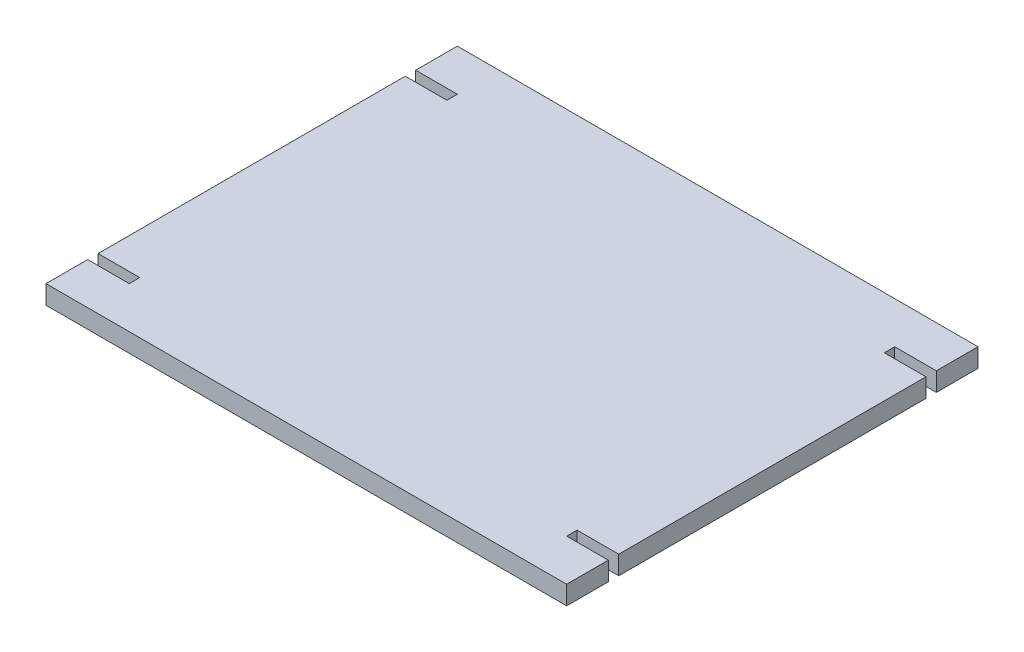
ISO-10303-21;
HEADER;
FILE_DESCRIPTION(('STEP AP214'),'2;1');
FILE_NAME('part.step','',(''),(''),'','','');
FILE_SCHEMA(('AUTOMOTIVE_DESIGN { 1 0 10303 214 1 1 1 1 }'));
ENDSEC;
DATA;
#1=APPLICATION_CONTEXT('core data for automotive mechanical design processes');
#2=APPLICATION_PROTOCOL_DEFINITION('international standard','automotive_design',2000,#1);
#3=PRODUCT_CONTEXT('',#1,'mechanical');
#4=PRODUCT('Part','Part','',(#3));
#5=PRODUCT_RELATED_PRODUCT_CATEGORY('part','',(#4));
#6=PRODUCT_DEFINITION_FORMATION('','',#4);
#7=PRODUCT_DEFINITION_CONTEXT('part definition',#1,'design');
#8=PRODUCT_DEFINITION('design','',#6,#7);
#9=PRODUCT_DEFINITION_SHAPE('','',#8);
#10=(LENGTH_UNIT() NAMED_UNIT(*) SI_UNIT(.MILLI.,.METRE.));
#11=(NAMED_UNIT(*) PLANE_ANGLE_UNIT() SI_UNIT($,.RADIAN.));
#12=(NAMED_UNIT(*) SI_UNIT($,.STERADIAN.) SOLID_ANGLE_UNIT());
#13=UNCERTAINTY_MEASURE_WITH_UNIT(LENGTH_MEASURE(1.E-05),#10,'distance_accuracy_value','');
#14=(GEOMETRIC_REPRESENTATION_CONTEXT(3) GLOBAL_UNCERTAINTY_ASSIGNED_CONTEXT((#13)) GLOBAL_UNIT_ASSIGNED_CONTEXT((#10,
#11,#12)) REPRESENTATION_CONTEXT('',''));
#15=CARTESIAN_POINT('',(0.,0.,0.));
#16=DIRECTION('',(0.,0.,1.));
#17=DIRECTION('',(1.,0.,0.));
#18=AXIS2_PLACEMENT_3D('',#15,#16,#17);
#19=CARTESIAN_POINT('',(-301.875,18.,-168.229166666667));
#20=DIRECTION('',(1.,0.,0.));
#21=DIRECTION('',(0.,0.,-1.));
#22=AXIS2_PLACEMENT_3D('',#19,#20,#21);
#23=PLANE('',#22);
#24=DIRECTION('',(0.,0.,1.));
#25=VECTOR('',#24,1.);
#26=CARTESIAN_POINT('',(-301.875,0.,-168.229166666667));
#27=LINE('',#26,#25);
#28=CARTESIAN_POINT('',(-301.875,0.,-208.229166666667));
#29=VERTEX_POINT('',#28);
#30=CARTESIAN_POINT('',(-301.875,0.,-168.229166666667));
#31=VERTEX_POINT('',#30);
#32=EDGE_CURVE('E203',#29,#31,#27,.T.);
#33=ORIENTED_EDGE('',*,*,#32,.T.);
#34=DIRECTION('',(0.,-1.,0.));
#35=VECTOR('',#34,1.);
#36=CARTESIAN_POINT('',(-301.875,18.,-168.229166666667));
#37=LINE('',#36,#35);
#38=CARTESIAN_POINT('',(-301.875,18.,-168.229166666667));
#39=VERTEX_POINT('',#38);
#40=EDGE_CURVE('E11',#39,#31,#37,.T.);
#41=ORIENTED_EDGE('',*,*,#40,.F.);
#42=DIRECTION('',(0.,0.,1.));
#43=VECTOR('',#42,1.);
#44=CARTESIAN_POINT('',(-301.875,18.,-168.229166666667));
#45=LINE('',#44,#43);
#46=CARTESIAN_POINT('',(-301.875,18.,-208.229166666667));
#47=VERTEX_POINT('',#46);
#48=EDGE_CURVE('E241',#47,#39,#45,.T.);
#49=ORIENTED_EDGE('',*,*,#48,.F.);
#50=DIRECTION('',(0.,-1.,0.));
#51=VECTOR('',#50,1.);
#52=CARTESIAN_POINT('',(-301.875,18.,-208.229166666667));
#53=LINE('',#52,#51);
#54=EDGE_CURVE('E199',#47,#29,#53,.T.);
#55=ORIENTED_EDGE('',*,*,#54,.T.);
#56=EDGE_LOOP('',(#33,#41,#49,#55));
#57=FACE_BOUND('',#56,.T.);
#58=ADVANCED_FACE('F35',(#57),#23,.F.);
#59=CARTESIAN_POINT('',(-261.875,18.,-168.229166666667));
#60=DIRECTION('',(0.,0.,-1.));
#61=DIRECTION('',(-1.,0.,0.));
#62=AXIS2_PLACEMENT_3D('',#59,#60,#61);
#63=PLANE('',#62);
#64=DIRECTION('',(1.,0.,0.));
#65=VECTOR('',#64,1.);
#66=CARTESIAN_POINT('',(-261.875,0.,-168.229166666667));
#67=LINE('',#66,#65);
#68=CARTESIAN_POINT('',(-261.875,0.,-168.229166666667));
#69=VERTEX_POINT('',#68);
#70=EDGE_CURVE('E206',#31,#69,#67,.T.);
#71=ORIENTED_EDGE('',*,*,#70,.T.);
#72=DIRECTION('',(0.,-1.,0.));
#73=VECTOR('',#72,1.);
#74=CARTESIAN_POINT('',(-261.875,18.,-168.229166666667));
#75=LINE('',#74,#73);
#76=CARTESIAN_POINT('',(-261.875,18.,-168.229166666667));
#77=VERTEX_POINT('',#76);
#78=EDGE_CURVE('E43',#77,#69,#75,.T.);
#79=ORIENTED_EDGE('',*,*,#78,.F.);
#80=DIRECTION('',(1.,0.,0.));
#81=VECTOR('',#80,1.);
#82=CARTESIAN_POINT('',(-261.875,18.,-168.229166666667));
#83=LINE('',#82,#81);
#84=EDGE_CURVE('E130',#39,#77,#83,.T.);
#85=ORIENTED_EDGE('',*,*,#84,.F.);
#86=ORIENTED_EDGE('',*,*,#40,.T.);
#87=EDGE_LOOP('',(#71,#79,#85,#86));
#88=FACE_BOUND('',#87,.T.);
#89=ADVANCED_FACE('F359',(#88),#63,.F.);
#90=CARTESIAN_POINT('',(-261.875,18.,-158.229166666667));
#91=DIRECTION('',(1.,0.,0.));
#92=DIRECTION('',(0.,0.,-1.));
#93=AXIS2_PLACEMENT_3D('',#90,#91,#92);
#94=PLANE('',#93);
#95=DIRECTION('',(0.,0.,1.));
#96=VECTOR('',#95,1.);
#97=CARTESIAN_POINT('',(-261.875,0.,-158.229166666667));
#98=LINE('',#97,#96);
#99=CARTESIAN_POINT('',(-261.875,0.,-158.229166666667));
#100=VERTEX_POINT('',#99);
#101=EDGE_CURVE('E208',#69,#100,#98,.T.);
#102=ORIENTED_EDGE('',*,*,#101,.T.);
#103=DIRECTION('',(0.,-1.,0.));
#104=VECTOR('',#103,1.);
#105=CARTESIAN_POINT('',(-261.875,18.,-158.229166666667));
#106=LINE('',#105,#104);
#107=CARTESIAN_POINT('',(-261.875,18.,-158.229166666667));
#108=VERTEX_POINT('',#107);
#109=EDGE_CURVE('E284',#108,#100,#106,.T.);
#110=ORIENTED_EDGE('',*,*,#109,.F.);
#111=DIRECTION('',(0.,0.,1.));
#112=VECTOR('',#111,1.);
#113=CARTESIAN_POINT('',(-261.875,18.,-158.229166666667));
#114=LINE('',#113,#112);
#115=EDGE_CURVE('E292',#77,#108,#114,.T.);
#116=ORIENTED_EDGE('',*,*,#115,.F.);
#117=ORIENTED_EDGE('',*,*,#78,.T.);
#118=EDGE_LOOP('',(#102,#110,#116,#117));
#119=FACE_BOUND('',#118,.T.);
#120=ADVANCED_FACE('F290',(#119),#94,.F.);
#121=CARTESIAN_POINT('',(-301.875,18.,-158.229166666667));
#122=DIRECTION('',(0.,0.,1.));
#123=DIRECTION('',(1.,0.,0.));
#124=AXIS2_PLACEMENT_3D('',#121,#122,#123);
#125=PLANE('',#124);
#126=DIRECTION('',(-1.,0.,0.));
#127=VECTOR('',#126,1.);
#128=CARTESIAN_POINT('',(-301.875,0.,-158.229166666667));
#129=LINE('',#128,#127);
#130=CARTESIAN_POINT('',(-301.875,0.,-158.229166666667));
#131=VERTEX_POINT('',#130);
#132=EDGE_CURVE('E210',#100,#131,#129,.T.);
#133=ORIENTED_EDGE('',*,*,#132,.T.);
#134=DIRECTION('',(0.,-1.,0.));
#135=VECTOR('',#134,1.);
#136=CARTESIAN_POINT('',(-301.875,18.,-158.229166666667));
#137=LINE('',#136,#135);
#138=CARTESIAN_POINT('',(-301.875,18.,-158.229166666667));
#139=VERTEX_POINT('',#138);
#140=EDGE_CURVE('E281',#139,#131,#137,.T.);
#141=ORIENTED_EDGE('',*,*,#140,.F.);
#142=DIRECTION('',(-1.,0.,0.));
#143=VECTOR('',#142,1.);
#144=CARTESIAN_POINT('',(-301.875,18.,-158.229166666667));
#145=LINE('',#144,#143);
#146=EDGE_CURVE('E310',#108,#139,#145,.T.);
#147=ORIENTED_EDGE('',*,*,#146,.F.);
#148=ORIENTED_EDGE('',*,*,#109,.T.);
#149=EDGE_LOOP('',(#133,#141,#147,#148));
#150=FACE_BOUND('',#149,.T.);
#151=ADVANCED_FACE('F301',(#150),#125,.F.);
#152=CARTESIAN_POINT('',(-301.875,18.,136.770833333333));
#153=DIRECTION('',(1.,0.,0.));
#154=DIRECTION('',(0.,0.,-1.));
#155=AXIS2_PLACEMENT_3D('',#152,#153,#154);
#156=PLANE('',#155);
#157=DIRECTION('',(0.,0.,1.));
#158=VECTOR('',#157,1.);
#159=CARTESIAN_POINT('',(-301.875,0.,136.770833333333));
#160=LINE('',#159,#158);
#161=CARTESIAN_POINT('',(-301.875,0.,136.770833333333));
#162=VERTEX_POINT('',#161);
#163=EDGE_CURVE('E212',#131,#162,#160,.T.);
#164=ORIENTED_EDGE('',*,*,#163,.T.);
#165=DIRECTION('',(0.,-1.,0.));
#166=VECTOR('',#165,1.);
#167=CARTESIAN_POINT('',(-301.875,18.,136.770833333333));
#168=LINE('',#167,#166);
#169=CARTESIAN_POINT('',(-301.875,18.,136.770833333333));
#170=VERTEX_POINT('',#169);
#171=EDGE_CURVE('E278',#170,#162,#168,.T.);
#172=ORIENTED_EDGE('',*,*,#171,.F.);
#173=DIRECTION('',(0.,0.,1.));
#174=VECTOR('',#173,1.);
#175=CARTESIAN_POINT('',(-301.875,18.,136.770833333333));
#176=LINE('',#175,#174);
#177=EDGE_CURVE('E307',#139,#170,#176,.T.);
#178=ORIENTED_EDGE('',*,*,#177,.F.);
#179=ORIENTED_EDGE('',*,*,#140,.T.);
#180=EDGE_LOOP('',(#164,#172,#178,#179));
#181=FACE_BOUND('',#180,.T.);
#182=ADVANCED_FACE('F305',(#181),#156,.F.);
#183=CARTESIAN_POINT('',(-261.875,18.,136.770833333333));
#184=DIRECTION('',(0.,0.,-1.));
#185=DIRECTION('',(-1.,0.,0.));
#186=AXIS2_PLACEMENT_3D('',#183,#184,#185);
#187=PLANE('',#186);
#188=DIRECTION('',(1.,0.,0.));
#189=VECTOR('',#188,1.);
#190=CARTESIAN_POINT('',(-261.875,0.,136.770833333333));
#191=LINE('',#190,#189);
#192=CARTESIAN_POINT('',(-261.875,0.,136.770833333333));
#193=VERTEX_POINT('',#192);
#194=EDGE_CURVE('E214',#162,#193,#191,.T.);
#195=ORIENTED_EDGE('',*,*,#194,.T.);
#196=DIRECTION('',(0.,-1.,0.));
#197=VECTOR('',#196,1.);
#198=CARTESIAN_POINT('',(-261.875,18.,136.770833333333));
#199=LINE('',#198,#197);
#200=CARTESIAN_POINT('',(-261.875,18.,136.770833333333));
#201=VERTEX_POINT('',#200);
#202=EDGE_CURVE('E275',#201,#193,#199,.T.);
#203=ORIENTED_EDGE('',*,*,#202,.F.);
#204=DIRECTION('',(1.,0.,0.));
#205=VECTOR('',#204,1.);
#206=CARTESIAN_POINT('',(-261.875,18.,136.770833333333));
#207=LINE('',#206,#205);
#208=EDGE_CURVE('E309',#170,#201,#207,.T.);
#209=ORIENTED_EDGE('',*,*,#208,.F.);
#210=ORIENTED_EDGE('',*,*,#171,.T.);
#211=EDGE_LOOP('',(#195,#203,#209,#210));
#212=FACE_BOUND('',#211,.T.);
#213=ADVANCED_FACE('F372',(#212),#187,.F.);
#214=CARTESIAN_POINT('',(-261.875,18.,146.770833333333));
#215=DIRECTION('',(1.,0.,0.));
#216=DIRECTION('',(0.,0.,-1.));
#217=AXIS2_PLACEMENT_3D('',#214,#215,#216);
#218=PLANE('',#217);
#219=DIRECTION('',(0.,0.,1.));
#220=VECTOR('',#219,1.);
#221=CARTESIAN_POINT('',(-261.875,0.,146.770833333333));
#222=LINE('',#221,#220);
#223=CARTESIAN_POINT('',(-261.875,0.,146.770833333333));
#224=VERTEX_POINT('',#223);
#225=EDGE_CURVE('E216',#193,#224,#222,.T.);
#226=ORIENTED_EDGE('',*,*,#225,.T.);
#227=DIRECTION('',(0.,-1.,0.));
#228=VECTOR('',#227,1.);
#229=CARTESIAN_POINT('',(-261.875,18.,146.770833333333));
#230=LINE('',#229,#228);
#231=CARTESIAN_POINT('',(-261.875,18.,146.770833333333));
#232=VERTEX_POINT('',#231);
#233=EDGE_CURVE('E272',#232,#224,#230,.T.);
#234=ORIENTED_EDGE('',*,*,#233,.F.);
#235=DIRECTION('',(0.,0.,1.));
#236=VECTOR('',#235,1.);
#237=CARTESIAN_POINT('',(-261.875,18.,146.770833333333));
#238=LINE('',#237,#236);
#239=EDGE_CURVE('E312',#201,#232,#238,.T.);
#240=ORIENTED_EDGE('',*,*,#239,.F.);
#241=ORIENTED_EDGE('',*,*,#202,.T.);
#242=EDGE_LOOP('',(#226,#234,#240,#241));
#243=FACE_BOUND('',#242,.T.);
#244=ADVANCED_FACE('F375',(#243),#218,.F.);
#245=CARTESIAN_POINT('',(-301.875,18.,146.770833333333));
#246=DIRECTION('',(0.,0.,1.));
#247=DIRECTION('',(1.,0.,0.));
#248=AXIS2_PLACEMENT_3D('',#245,#246,#247);
#249=PLANE('',#248);
#250=DIRECTION('',(-1.,0.,0.));
#251=VECTOR('',#250,1.);
#252=CARTESIAN_POINT('',(-301.875,0.,146.770833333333));
#253=LINE('',#252,#251);
#254=CARTESIAN_POINT('',(-301.875,0.,146.770833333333));
#255=VERTEX_POINT('',#254);
#256=EDGE_CURVE('E218',#224,#255,#253,.T.);
#257=ORIENTED_EDGE('',*,*,#256,.T.);
#258=DIRECTION('',(0.,-1.,0.));
#259=VECTOR('',#258,1.);
#260=CARTESIAN_POINT('',(-301.875,18.,146.770833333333));
#261=LINE('',#260,#259);
#262=CARTESIAN_POINT('',(-301.875,18.,146.770833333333));
#263=VERTEX_POINT('',#262);
#264=EDGE_CURVE('E269',#263,#255,#261,.T.);
#265=ORIENTED_EDGE('',*,*,#264,.F.);
#266=DIRECTION('',(-1.,0.,0.));
#267=VECTOR('',#266,1.);
#268=CARTESIAN_POINT('',(-301.875,18.,146.770833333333));
#269=LINE('',#268,#267);
#270=EDGE_CURVE('E318',#232,#263,#269,.T.);
#271=ORIENTED_EDGE('',*,*,#270,.F.);
#272=ORIENTED_EDGE('',*,*,#233,.T.);
#273=EDGE_LOOP('',(#257,#265,#271,#272));
#274=FACE_BOUND('',#273,.T.);
#275=ADVANCED_FACE('F379',(#274),#249,.F.);
#276=CARTESIAN_POINT('',(-301.875,18.,186.770833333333));
#277=DIRECTION('',(1.,0.,0.));
#278=DIRECTION('',(0.,0.,-1.));
#279=AXIS2_PLACEMENT_3D('',#276,#277,#278);
#280=PLANE('',#279);
#281=DIRECTION('',(0.,0.,1.));
#282=VECTOR('',#281,1.);
#283=CARTESIAN_POINT('',(-301.875,0.,186.770833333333));
#284=LINE('',#283,#282);
#285=CARTESIAN_POINT('',(-301.875,0.,186.770833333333));
#286=VERTEX_POINT('',#285);
#287=EDGE_CURVE('E220',#255,#286,#284,.T.);
#288=ORIENTED_EDGE('',*,*,#287,.T.);
#289=DIRECTION('',(0.,-1.,0.));
#290=VECTOR('',#289,1.);
#291=CARTESIAN_POINT('',(-301.875,18.,186.770833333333));
#292=LINE('',#291,#290);
#293=CARTESIAN_POINT('',(-301.875,18.,186.770833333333));
#294=VERTEX_POINT('',#293);
#295=EDGE_CURVE('E266',#294,#286,#292,.T.);
#296=ORIENTED_EDGE('',*,*,#295,.F.);
#297=DIRECTION('',(0.,0.,1.));
#298=VECTOR('',#297,1.);
#299=CARTESIAN_POINT('',(-301.875,18.,186.770833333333));
#300=LINE('',#299,#298);
#301=EDGE_CURVE('E320',#263,#294,#300,.T.);
#302=ORIENTED_EDGE('',*,*,#301,.F.);
#303=ORIENTED_EDGE('',*,*,#264,.T.);
#304=EDGE_LOOP('',(#288,#296,#302,#303));
#305=FACE_BOUND('',#304,.T.);
#306=ADVANCED_FACE('F383',(#305),#280,.F.);
#307=CARTESIAN_POINT('',(198.125,18.,186.770833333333));
#308=DIRECTION('',(0.,0.,-1.));
#309=DIRECTION('',(-1.,0.,0.));
#310=AXIS2_PLACEMENT_3D('',#307,#308,#309);
#311=PLANE('',#310);
#312=DIRECTION('',(1.,0.,0.));
#313=VECTOR('',#312,1.);
#314=CARTESIAN_POINT('',(198.125,0.,186.770833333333));
#315=LINE('',#314,#313);
#316=CARTESIAN_POINT('',(198.125,0.,186.770833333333));
#317=VERTEX_POINT('',#316);
#318=EDGE_CURVE('E222',#286,#317,#315,.T.);
#319=ORIENTED_EDGE('',*,*,#318,.T.);
#320=DIRECTION('',(0.,-1.,0.));
#321=VECTOR('',#320,1.);
#322=CARTESIAN_POINT('',(198.125,18.,186.770833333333));
#323=LINE('',#322,#321);
#324=CARTESIAN_POINT('',(198.125,18.,186.770833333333));
#325=VERTEX_POINT('',#324);
#326=EDGE_CURVE('E263',#325,#317,#323,.T.);
#327=ORIENTED_EDGE('',*,*,#326,.F.);
#328=DIRECTION('',(1.,0.,0.));
#329=VECTOR('',#328,1.);
#330=CARTESIAN_POINT('',(198.125,18.,186.770833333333));
#331=LINE('',#330,#329);
#332=EDGE_CURVE('E322',#294,#325,#331,.T.);
#333=ORIENTED_EDGE('',*,*,#332,.F.);
#334=ORIENTED_EDGE('',*,*,#295,.T.);
#335=EDGE_LOOP('',(#319,#327,#333,#334));
#336=FACE_BOUND('',#335,.T.);
#337=ADVANCED_FACE('F387',(#336),#311,.F.);
#338=CARTESIAN_POINT('',(198.125,18.,146.770833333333));
#339=DIRECTION('',(-1.,0.,0.));
#340=DIRECTION('',(0.,0.,1.));
#341=AXIS2_PLACEMENT_3D('',#338,#339,#340);
#342=PLANE('',#341);
#343=DIRECTION('',(0.,0.,-1.));
#344=VECTOR('',#343,1.);
#345=CARTESIAN_POINT('',(198.125,0.,146.770833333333));
#346=LINE('',#345,#344);
#347=CARTESIAN_POINT('',(198.125,0.,146.770833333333));
#348=VERTEX_POINT('',#347);
#349=EDGE_CURVE('E224',#317,#348,#346,.T.);
#350=ORIENTED_EDGE('',*,*,#349,.T.);
#351=DIRECTION('',(0.,-1.,0.));
#352=VECTOR('',#351,1.);
#353=CARTESIAN_POINT('',(198.125,18.,146.770833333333));
#354=LINE('',#353,#352);
#355=CARTESIAN_POINT('',(198.125,18.,146.770833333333));
#356=VERTEX_POINT('',#355);
#357=EDGE_CURVE('E260',#356,#348,#354,.T.);
#358=ORIENTED_EDGE('',*,*,#357,.F.);
#359=DIRECTION('',(0.,0.,-1.));
#360=VECTOR('',#359,1.);
#361=CARTESIAN_POINT('',(198.125,18.,146.770833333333));
#362=LINE('',#361,#360);
#363=EDGE_CURVE('E324',#325,#356,#362,.T.);
#364=ORIENTED_EDGE('',*,*,#363,.F.);
#365=ORIENTED_EDGE('',*,*,#326,.T.);
#366=EDGE_LOOP('',(#350,#358,#364,#365));
#367=FACE_BOUND('',#366,.T.);
#368=ADVANCED_FACE('F391',(#367),#342,.F.);
#369=CARTESIAN_POINT('',(158.125,18.,146.770833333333));
#370=DIRECTION('',(0.,0.,1.));
#371=DIRECTION('',(1.,0.,0.));
#372=AXIS2_PLACEMENT_3D('',#369,#370,#371);
#373=PLANE('',#372);
#374=DIRECTION('',(-1.,0.,0.));
#375=VECTOR('',#374,1.);
#376=CARTESIAN_POINT('',(158.125,0.,146.770833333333));
#377=LINE('',#376,#375);
#378=CARTESIAN_POINT('',(158.125,0.,146.770833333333));
#379=VERTEX_POINT('',#378);
#380=EDGE_CURVE('E226',#348,#379,#377,.T.);
#381=ORIENTED_EDGE('',*,*,#380,.T.);
#382=DIRECTION('',(0.,-1.,0.));
#383=VECTOR('',#382,1.);
#384=CARTESIAN_POINT('',(158.125,18.,146.770833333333));
#385=LINE('',#384,#383);
#386=CARTESIAN_POINT('',(158.125,18.,146.770833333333));
#387=VERTEX_POINT('',#386);
#388=EDGE_CURVE('E257',#387,#379,#385,.T.);
#389=ORIENTED_EDGE('',*,*,#388,.F.);
#390=DIRECTION('',(-1.,0.,0.));
#391=VECTOR('',#390,1.);
#392=CARTESIAN_POINT('',(158.125,18.,146.770833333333));
#393=LINE('',#392,#391);
#394=EDGE_CURVE('E326',#356,#387,#393,.T.);
#395=ORIENTED_EDGE('',*,*,#394,.F.);
#396=ORIENTED_EDGE('',*,*,#357,.T.);
#397=EDGE_LOOP('',(#381,#389,#395,#396));
#398=FACE_BOUND('',#397,.T.);
#399=ADVANCED_FACE('F395',(#398),#373,.F.);
#400=CARTESIAN_POINT('',(158.125,18.,136.770833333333));
#401=DIRECTION('',(-1.,0.,0.));
#402=DIRECTION('',(0.,0.,1.));
#403=AXIS2_PLACEMENT_3D('',#400,#401,#402);
#404=PLANE('',#403);
#405=DIRECTION('',(0.,0.,-1.));
#406=VECTOR('',#405,1.);
#407=CARTESIAN_POINT('',(158.125,0.,136.770833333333));
#408=LINE('',#407,#406);
#409=CARTESIAN_POINT('',(158.125,0.,136.770833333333));
#410=VERTEX_POINT('',#409);
#411=EDGE_CURVE('E228',#379,#410,#408,.T.);
#412=ORIENTED_EDGE('',*,*,#411,.T.);
#413=DIRECTION('',(0.,-1.,0.));
#414=VECTOR('',#413,1.);
#415=CARTESIAN_POINT('',(158.125,18.,136.770833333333));
#416=LINE('',#415,#414);
#417=CARTESIAN_POINT('',(158.125,18.,136.770833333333));
#418=VERTEX_POINT('',#417);
#419=EDGE_CURVE('E254',#418,#410,#416,.T.);
#420=ORIENTED_EDGE('',*,*,#419,.F.);
#421=DIRECTION('',(0.,0.,-1.));
#422=VECTOR('',#421,1.);
#423=CARTESIAN_POINT('',(158.125,18.,136.770833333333));
#424=LINE('',#423,#422);
#425=EDGE_CURVE('E328',#387,#418,#424,.T.);
#426=ORIENTED_EDGE('',*,*,#425,.F.);
#427=ORIENTED_EDGE('',*,*,#388,.T.);
#428=EDGE_LOOP('',(#412,#420,#426,#427));
#429=FACE_BOUND('',#428,.T.);
#430=ADVANCED_FACE('F399',(#429),#404,.F.);
#431=CARTESIAN_POINT('',(198.125,18.,136.770833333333));
#432=DIRECTION('',(0.,0.,-1.));
#433=DIRECTION('',(-1.,0.,0.));
#434=AXIS2_PLACEMENT_3D('',#431,#432,#433);
#435=PLANE('',#434);
#436=DIRECTION('',(1.,0.,0.));
#437=VECTOR('',#436,1.);
#438=CARTESIAN_POINT('',(198.125,0.,136.770833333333));
#439=LINE('',#438,#437);
#440=CARTESIAN_POINT('',(198.125,0.,136.770833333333));
#441=VERTEX_POINT('',#440);
#442=EDGE_CURVE('E230',#410,#441,#439,.T.);
#443=ORIENTED_EDGE('',*,*,#442,.T.);
#444=DIRECTION('',(0.,-1.,0.));
#445=VECTOR('',#444,1.);
#446=CARTESIAN_POINT('',(198.125,18.,136.770833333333));
#447=LINE('',#446,#445);
#448=CARTESIAN_POINT('',(198.125,18.,136.770833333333));
#449=VERTEX_POINT('',#448);
#450=EDGE_CURVE('E251',#449,#441,#447,.T.);
#451=ORIENTED_EDGE('',*,*,#450,.F.);
#452=DIRECTION('',(1.,0.,0.));
#453=VECTOR('',#452,1.);
#454=CARTESIAN_POINT('',(198.125,18.,136.770833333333));
#455=LINE('',#454,#453);
#456=EDGE_CURVE('E330',#418,#449,#455,.T.);
#457=ORIENTED_EDGE('',*,*,#456,.F.);
#458=ORIENTED_EDGE('',*,*,#419,.T.);
#459=EDGE_LOOP('',(#443,#451,#457,#458));
#460=FACE_BOUND('',#459,.T.);
#461=ADVANCED_FACE('F403',(#460),#435,.F.);
#462=CARTESIAN_POINT('',(198.125,18.,-158.229166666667));
#463=DIRECTION('',(-1.,0.,0.));
#464=DIRECTION('',(0.,0.,1.));
#465=AXIS2_PLACEMENT_3D('',#462,#463,#464);
#466=PLANE('',#465);
#467=DIRECTION('',(0.,0.,-1.));
#468=VECTOR('',#467,1.);
#469=CARTESIAN_POINT('',(198.125,0.,-158.229166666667));
#470=LINE('',#469,#468);
#471=CARTESIAN_POINT('',(198.125,0.,-158.229166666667));
#472=VERTEX_POINT('',#471);
#473=EDGE_CURVE('E232',#441,#472,#470,.T.);
#474=ORIENTED_EDGE('',*,*,#473,.T.);
#475=DIRECTION('',(0.,-1.,0.));
#476=VECTOR('',#475,1.);
#477=CARTESIAN_POINT('',(198.125,18.,-158.229166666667));
#478=LINE('',#477,#476);
#479=CARTESIAN_POINT('',(198.125,18.,-158.229166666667));
#480=VERTEX_POINT('',#479);
#481=EDGE_CURVE('E248',#480,#472,#478,.T.);
#482=ORIENTED_EDGE('',*,*,#481,.F.);
#483=DIRECTION('',(0.,0.,-1.));
#484=VECTOR('',#483,1.);
#485=CARTESIAN_POINT('',(198.125,18.,-158.229166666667));
#486=LINE('',#485,#484);
#487=EDGE_CURVE('E332',#449,#480,#486,.T.);
#488=ORIENTED_EDGE('',*,*,#487,.F.);
#489=ORIENTED_EDGE('',*,*,#450,.T.);
#490=EDGE_LOOP('',(#474,#482,#488,#489));
#491=FACE_BOUND('',#490,.T.);
#492=ADVANCED_FACE('F407',(#491),#466,.F.);
#493=CARTESIAN_POINT('',(158.125,18.,-158.229166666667));
#494=DIRECTION('',(0.,0.,1.));
#495=DIRECTION('',(1.,0.,0.));
#496=AXIS2_PLACEMENT_3D('',#493,#494,#495);
#497=PLANE('',#496);
#498=DIRECTION('',(-1.,0.,0.));
#499=VECTOR('',#498,1.);
#500=CARTESIAN_POINT('',(158.125,0.,-158.229166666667));
#501=LINE('',#500,#499);
#502=CARTESIAN_POINT('',(158.125,0.,-158.229166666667));
#503=VERTEX_POINT('',#502);
#504=EDGE_CURVE('E234',#472,#503,#501,.T.);
#505=ORIENTED_EDGE('',*,*,#504,.T.);
#506=DIRECTION('',(0.,-1.,0.));
#507=VECTOR('',#506,1.);
#508=CARTESIAN_POINT('',(158.125,18.,-158.229166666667));
#509=LINE('',#508,#507);
#510=CARTESIAN_POINT('',(158.125,18.,-158.229166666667));
#511=VERTEX_POINT('',#510);
#512=EDGE_CURVE('E245',#511,#503,#509,.T.);
#513=ORIENTED_EDGE('',*,*,#512,.F.);
#514=DIRECTION('',(-1.,0.,0.));
#515=VECTOR('',#514,1.);
#516=CARTESIAN_POINT('',(158.125,18.,-158.229166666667));
#517=LINE('',#516,#515);
#518=EDGE_CURVE('E334',#480,#511,#517,.T.);
#519=ORIENTED_EDGE('',*,*,#518,.F.);
#520=ORIENTED_EDGE('',*,*,#481,.T.);
#521=EDGE_LOOP('',(#505,#513,#519,#520));
#522=FACE_BOUND('',#521,.T.);
#523=ADVANCED_FACE('F340',(#522),#497,.F.);
#524=CARTESIAN_POINT('',(158.125,18.,-168.229166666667));
#525=DIRECTION('',(-1.,0.,0.));
#526=DIRECTION('',(0.,0.,1.));
#527=AXIS2_PLACEMENT_3D('',#524,#525,#526);
#528=PLANE('',#527);
#529=DIRECTION('',(0.,0.,-1.));
#530=VECTOR('',#529,1.);
#531=CARTESIAN_POINT('',(158.125,0.,-168.229166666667));
#532=LINE('',#531,#530);
#533=CARTESIAN_POINT('',(158.125,0.,-168.229166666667));
#534=VERTEX_POINT('',#533);
#535=EDGE_CURVE('E236',#503,#534,#532,.T.);
#536=ORIENTED_EDGE('',*,*,#535,.T.);
#537=DIRECTION('',(0.,-1.,0.));
#538=VECTOR('',#537,1.);
#539=CARTESIAN_POINT('',(158.125,18.,-168.229166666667));
#540=LINE('',#539,#538);
#541=CARTESIAN_POINT('',(158.125,18.,-168.229166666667));
#542=VERTEX_POINT('',#541);
#543=EDGE_CURVE('E194',#542,#534,#540,.T.);
#544=ORIENTED_EDGE('',*,*,#543,.F.);
#545=DIRECTION('',(0.,0.,-1.));
#546=VECTOR('',#545,1.);
#547=CARTESIAN_POINT('',(158.125,18.,-168.229166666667));
#548=LINE('',#547,#546);
#549=EDGE_CURVE('E185',#511,#542,#548,.T.);
#550=ORIENTED_EDGE('',*,*,#549,.F.);
#551=ORIENTED_EDGE('',*,*,#512,.T.);
#552=EDGE_LOOP('',(#536,#544,#550,#551));
#553=FACE_BOUND('',#552,.T.);
#554=ADVANCED_FACE('F344',(#553),#528,.F.);
#555=CARTESIAN_POINT('',(198.125,18.,-168.229166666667));
#556=DIRECTION('',(0.,0.,-1.));
#557=DIRECTION('',(-1.,0.,0.));
#558=AXIS2_PLACEMENT_3D('',#555,#556,#557);
#559=PLANE('',#558);
#560=DIRECTION('',(1.,0.,0.));
#561=VECTOR('',#560,1.);
#562=CARTESIAN_POINT('',(198.125,0.,-168.229166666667));
#563=LINE('',#562,#561);
#564=CARTESIAN_POINT('',(198.125,0.,-168.229166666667));
#565=VERTEX_POINT('',#564);
#566=EDGE_CURVE('E193',#534,#565,#563,.T.);
#567=ORIENTED_EDGE('',*,*,#566,.T.);
#568=DIRECTION('',(0.,-1.,0.));
#569=VECTOR('',#568,1.);
#570=CARTESIAN_POINT('',(198.125,18.,-168.229166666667));
#571=LINE('',#570,#569);
#572=CARTESIAN_POINT('',(198.125,18.,-168.229166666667));
#573=VERTEX_POINT('',#572);
#574=EDGE_CURVE('E190',#573,#565,#571,.T.);
#575=ORIENTED_EDGE('',*,*,#574,.F.);
#576=DIRECTION('',(1.,0.,0.));
#577=VECTOR('',#576,1.);
#578=CARTESIAN_POINT('',(198.125,18.,-168.229166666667));
#579=LINE('',#578,#577);
#580=EDGE_CURVE('E179',#542,#573,#579,.T.);
#581=ORIENTED_EDGE('',*,*,#580,.F.);
#582=ORIENTED_EDGE('',*,*,#543,.T.);
#583=EDGE_LOOP('',(#567,#575,#581,#582));
#584=FACE_BOUND('',#583,.T.);
#585=ADVANCED_FACE('F191',(#584),#559,.F.);
#586=CARTESIAN_POINT('',(198.125,18.,-208.229166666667));
#587=DIRECTION('',(-1.,0.,0.));
#588=DIRECTION('',(0.,0.,1.));
#589=AXIS2_PLACEMENT_3D('',#586,#587,#588);
#590=PLANE('',#589);
#591=DIRECTION('',(0.,0.,-1.));
#592=VECTOR('',#591,1.);
#593=CARTESIAN_POINT('',(198.125,0.,-208.229166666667));
#594=LINE('',#593,#592);
#595=CARTESIAN_POINT('',(198.125,0.,-208.229166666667));
#596=VERTEX_POINT('',#595);
#597=EDGE_CURVE('E116',#565,#596,#594,.T.);
#598=ORIENTED_EDGE('',*,*,#597,.T.);
#599=DIRECTION('',(0.,-1.,0.));
#600=VECTOR('',#599,1.);
#601=CARTESIAN_POINT('',(198.125,18.,-208.229166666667));
#602=LINE('',#601,#600);
#603=CARTESIAN_POINT('',(198.125,18.,-208.229166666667));
#604=VERTEX_POINT('',#603);
#605=EDGE_CURVE('E195',#604,#596,#602,.T.);
#606=ORIENTED_EDGE('',*,*,#605,.F.);
#607=DIRECTION('',(0.,0.,-1.));
#608=VECTOR('',#607,1.);
#609=CARTESIAN_POINT('',(198.125,18.,-208.229166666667));
#610=LINE('',#609,#608);
#611=EDGE_CURVE('E183',#573,#604,#610,.T.);
#612=ORIENTED_EDGE('',*,*,#611,.F.);
#613=ORIENTED_EDGE('',*,*,#574,.T.);
#614=EDGE_LOOP('',(#598,#606,#612,#613));
#615=FACE_BOUND('',#614,.T.);
#616=ADVANCED_FACE('F197',(#615),#590,.F.);
#617=CARTESIAN_POINT('',(-301.875,18.,-208.229166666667));
#618=DIRECTION('',(0.,0.,1.));
#619=DIRECTION('',(1.,0.,0.));
#620=AXIS2_PLACEMENT_3D('',#617,#618,#619);
#621=PLANE('',#620);
#622=DIRECTION('',(-1.,0.,0.));
#623=VECTOR('',#622,1.);
#624=CARTESIAN_POINT('',(-301.875,0.,-208.229166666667));
#625=LINE('',#624,#623);
#626=EDGE_CURVE('E122',#596,#29,#625,.T.);
#627=ORIENTED_EDGE('',*,*,#626,.T.);
#628=ORIENTED_EDGE('',*,*,#54,.F.);
#629=DIRECTION('',(-1.,0.,0.));
#630=VECTOR('',#629,1.);
#631=CARTESIAN_POINT('',(-301.875,18.,-208.229166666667));
#632=LINE('',#631,#630);
#633=EDGE_CURVE('E51',#604,#47,#632,.T.);
#634=ORIENTED_EDGE('',*,*,#633,.F.);
#635=ORIENTED_EDGE('',*,*,#605,.T.);
#636=EDGE_LOOP('',(#627,#628,#634,#635));
#637=FACE_BOUND('',#636,.T.);
#638=ADVANCED_FACE('F348',(#637),#621,.F.);
#639=CARTESIAN_POINT('',(0.,18.,0.));
#640=DIRECTION('',(0.,-1.,0.));
#641=DIRECTION('',(0.,0.,-1.));
#642=AXIS2_PLACEMENT_3D('',#639,#640,#641);
#643=PLANE('',#642);
#644=ORIENTED_EDGE('',*,*,#48,.T.);
#645=ORIENTED_EDGE('',*,*,#84,.T.);
#646=ORIENTED_EDGE('',*,*,#115,.T.);
#647=ORIENTED_EDGE('',*,*,#146,.T.);
#648=ORIENTED_EDGE('',*,*,#177,.T.);
#649=ORIENTED_EDGE('',*,*,#208,.T.);
#650=ORIENTED_EDGE('',*,*,#239,.T.);
#651=ORIENTED_EDGE('',*,*,#270,.T.);
#652=ORIENTED_EDGE('',*,*,#301,.T.);
#653=ORIENTED_EDGE('',*,*,#332,.T.);
#654=ORIENTED_EDGE('',*,*,#363,.T.);
#655=ORIENTED_EDGE('',*,*,#394,.T.);
#656=ORIENTED_EDGE('',*,*,#425,.T.);
#657=ORIENTED_EDGE('',*,*,#456,.T.);
#658=ORIENTED_EDGE('',*,*,#487,.T.);
#659=ORIENTED_EDGE('',*,*,#518,.T.);
#660=ORIENTED_EDGE('',*,*,#549,.T.);
#661=ORIENTED_EDGE('',*,*,#580,.T.);
#662=ORIENTED_EDGE('',*,*,#611,.T.);
#663=ORIENTED_EDGE('',*,*,#633,.T.);
#664=EDGE_LOOP('',(#644,#645,#646,#647,#648,#649,#650,#651,#652,#653,#654,#655,#656,#657,#658,
#659,#660,#661,#662,#663));
#665=FACE_BOUND('',#664,.T.);
#666=ADVANCED_FACE('F181',(#665),#643,.F.);
#667=CARTESIAN_POINT('',(0.,0.,0.));
#668=DIRECTION('',(0.,-1.,0.));
#669=DIRECTION('',(0.,0.,-1.));
#670=AXIS2_PLACEMENT_3D('',#667,#668,#669);
#671=PLANE('',#670);
#672=ORIENTED_EDGE('',*,*,#32,.F.);
#673=ORIENTED_EDGE('',*,*,#626,.F.);
#674=ORIENTED_EDGE('',*,*,#597,.F.);
#675=ORIENTED_EDGE('',*,*,#566,.F.);
#676=ORIENTED_EDGE('',*,*,#535,.F.);
#677=ORIENTED_EDGE('',*,*,#504,.F.);
#678=ORIENTED_EDGE('',*,*,#473,.F.);
#679=ORIENTED_EDGE('',*,*,#442,.F.);
#680=ORIENTED_EDGE('',*,*,#411,.F.);
#681=ORIENTED_EDGE('',*,*,#380,.F.);
#682=ORIENTED_EDGE('',*,*,#349,.F.);
#683=ORIENTED_EDGE('',*,*,#318,.F.);
#684=ORIENTED_EDGE('',*,*,#287,.F.);
#685=ORIENTED_EDGE('',*,*,#256,.F.);
#686=ORIENTED_EDGE('',*,*,#225,.F.);
#687=ORIENTED_EDGE('',*,*,#194,.F.);
#688=ORIENTED_EDGE('',*,*,#163,.F.);
#689=ORIENTED_EDGE('',*,*,#132,.F.);
#690=ORIENTED_EDGE('',*,*,#101,.F.);
#691=ORIENTED_EDGE('',*,*,#70,.F.);
#692=EDGE_LOOP('',(#672,#673,#674,#675,#676,#677,#678,#679,#680,#681,#682,#683,#684,#685,#686,
#687,#688,#689,#690,#691));
#693=FACE_BOUND('',#692,.T.);
#694=ADVANCED_FACE('F296',(#693),#671,.T.);
#695=CLOSED_SHELL('',(#58,#89,#120,#151,#182,#213,#244,#275,#306,#337,#368,#399,#430,#461,#492,
#523,#554,#585,#616,#638,#666,#694));
#696=MANIFOLD_SOLID_BREP('B2',#695);
#697=ADVANCED_BREP_SHAPE_REPRESENTATION('',(#18,#696),#14);
#698=SHAPE_DEFINITION_REPRESENTATION(#9,#697);
ENDSEC;
END-ISO-10303-21;
